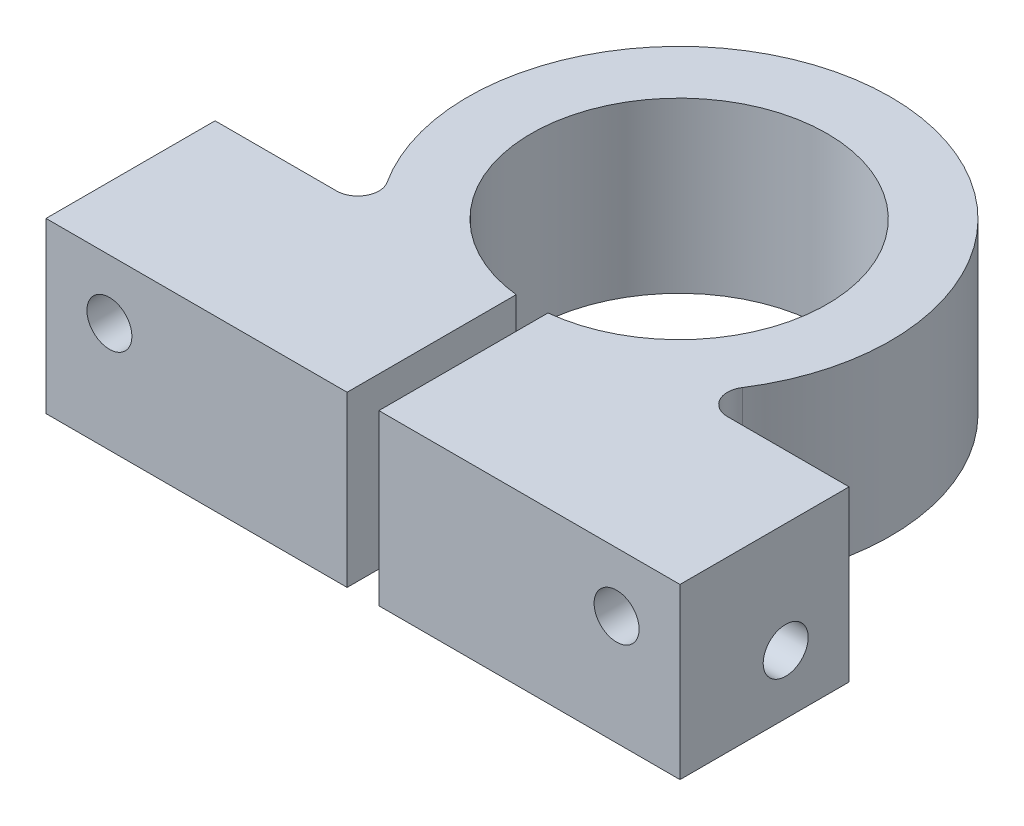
from build123d import *

# Parameters (mm, degrees)
EXTRUDE1_DEPTH          = 25.4
F_1_4_CLEARANCE_HOLE2_D = 6.7564
F_1_4_CLEARANCE_HOLE1_D = 6.7564
F_1_4_CLEARANCE_HOLE3_D = 6.7564


with BuildPart() as part:
    # Sketch1 → Extrude1 (new body)
    with BuildSketch(Plane(origin=(0, 0, 0), x_dir=(1, 0, 0), z_dir=(0, 1, 0))):
        with BuildLine():
            Line((2.3876, -47.496379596), (47.625, -47.496379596))
            Line((47.625, -47.496379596), (47.625, -22.096379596))
            Line((47.625, -22.096379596), (29.355357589, -22.096379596))
            ThreePointArc((29.355357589, -22.096379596), (26.567704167, -20.441120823), (26.686688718, -17.201254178))
            ThreePointArc((26.686688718, -17.201254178), (0, 31.75), (-26.686688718, -17.201254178))
            ThreePointArc((-26.686688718, -17.201254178), (-26.567704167, -20.441120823), (-29.355357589, -22.096379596))
            Line((-29.355357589, -22.096379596), (-47.625, -22.096379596))
            Line((-47.625, -22.096379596), (-47.625, -47.496379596))
            Line((-47.625, -47.496379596), (-2.3876, -47.496379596))
            Line((-2.3876, -47.496379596), (-2.3876, -22.096379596))
            ThreePointArc((-2.3876, -22.096379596), (0, 22.225), (2.3876, -22.096379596))
            Line((2.3876, -22.096379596), (2.3876, -47.496379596))
        make_face()
    extrude(amount=EXTRUDE1_DEPTH)

    # 1_4 Clearance Hole2 (through all)
    with Locations(Plane(origin=(-47.625, 8.89, 31.621379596), x_dir=(0, 0, -1), z_dir=(-1, 0, 0))):
        with Locations((0, 0)):
            Hole(F_1_4_CLEARANCE_HOLE2_D / 2)

    # 1_4 Clearance Hole1 (through all)
    with Locations(Plane(origin=(-38.1, 16.51, 22.096379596), x_dir=(-1, 0, 0), z_dir=(0, 0, -1))):
        with Locations((0, 0)):
            Hole(F_1_4_CLEARANCE_HOLE1_D / 2)

    # 1_4 Clearance Hole3 (through all)
    with Locations(Plane(origin=(38.1, 16.51, 22.096379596), x_dir=(-1, 0, 0), z_dir=(0, 0, -1))):
        with Locations((0, 0)):
            Hole(F_1_4_CLEARANCE_HOLE3_D / 2)


solid = part.part
